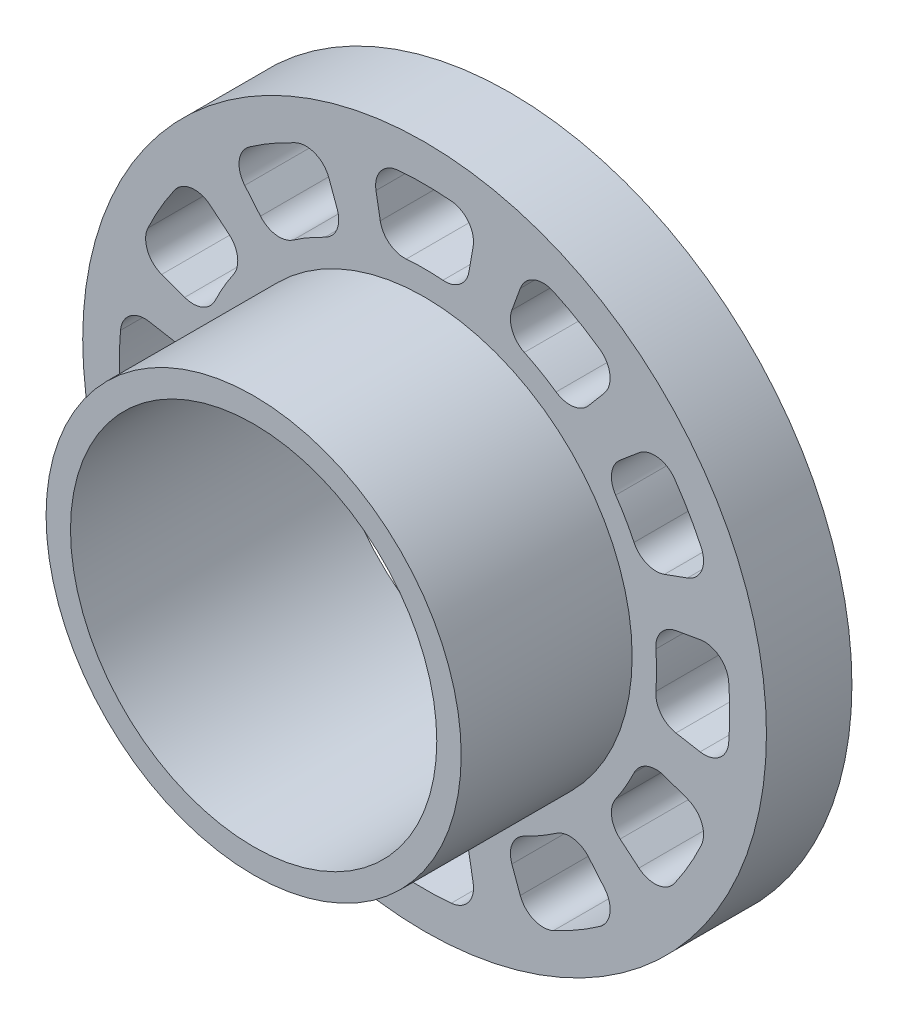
from build123d import *

# Parameters (mm, degrees)
SKETCH1_R           = 14
SKETCH1_R_2         = 7.5
BOSS_EXTRUDE1_DEPTH = 3.5
SKETCH2_R           = 8.5
SKETCH2_R_2         = 7.5
BOSS_EXTRUDE2_DEPTH = 7


with BuildPart() as part:
    # Sketch1 → Boss-Extrude1 (new body)
    with BuildSketch(Plane.XY):
        Circle(SKETCH1_R)
        Circle(SKETCH1_R_2, mode=Mode.SUBTRACT)
        with BuildLine():
            Line((-10.293478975, -1.815018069), (-11.282390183, -1.989389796))
            ThreePointArc((-11.282390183, -1.989389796), (-12.064720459, -1.79799625), (-12.452215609, -1.091937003))
            ThreePointArc((-12.452215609, -1.091937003), (-12.5, 0), (-12.452215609, 1.091937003))
            ThreePointArc((-12.452215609, 1.091937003), (-12.064720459, 1.79799625), (-11.282390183, 1.989389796))
            Line((-11.282390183, 1.989389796), (-10.293478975, 1.815018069))
            ThreePointArc((-10.293478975, 1.815018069), (-9.676250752, 1.442186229), (-9.4702579, 0.751142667))
            ThreePointArc((-9.4702579, 0.751142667), (-9.5, 0), (-9.4702579, -0.751142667))
            ThreePointArc((-9.4702579, -0.751142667), (-9.676250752, -1.442186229), (-10.293478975, -1.815018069))
        make_face(mode=Mode.SUBTRACT)
        with BuildLine():
            Line((-8.006905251, 6.718591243), (-8.776141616, 7.364057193))
            ThreePointArc((-8.776141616, 7.364057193), (-9.549356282, 7.589470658), (-10.237966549, 7.171752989))
            ThreePointArc((-10.237966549, 7.171752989), (-10.825317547, 6.25), (-11.329903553, 5.28046262))
            ThreePointArc((-11.329903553, 5.28046262), (-11.347352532, 4.475249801), (-10.765531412, 3.91833299))
            Line((-10.765531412, 3.91833299), (-9.82192332, 3.574887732))
            ThreePointArc((-9.82192332, 3.574887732), (-9.100972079, 3.589155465), (-8.577055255, 4.084620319))
            ThreePointArc((-8.577055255, 4.084620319), (-8.227241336, 4.75), (-7.825912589, 5.385637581))
            ThreePointArc((-7.825912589, 5.385637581), (-7.65878585, 6.087095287), (-8.006905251, 6.718591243))
        make_face(mode=Mode.SUBTRACT)
        with BuildLine():
            Line((-3.574887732, 9.82192332), (-3.91833299, 10.765531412))
            ThreePointArc((-3.91833299, 10.765531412), (-4.475249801, 11.347352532), (-5.28046262, 11.329903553))
            ThreePointArc((-5.28046262, 11.329903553), (-6.25, 10.825317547), (-7.171752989, 10.237966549))
            ThreePointArc((-7.171752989, 10.237966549), (-7.589470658, 9.549356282), (-7.364057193, 8.776141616))
            Line((-7.364057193, 8.776141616), (-6.718591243, 8.006905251))
            ThreePointArc((-6.718591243, 8.006905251), (-6.087095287, 7.65878585), (-5.385637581, 7.825912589))
            ThreePointArc((-5.385637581, 7.825912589), (-4.75, 8.227241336), (-4.084620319, 8.577055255))
            ThreePointArc((-4.084620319, 8.577055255), (-3.589155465, 9.100972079), (-3.574887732, 9.82192332))
        make_face(mode=Mode.SUBTRACT)
        with BuildLine():
            Line((1.815018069, 10.293478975), (1.989389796, 11.282390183))
            ThreePointArc((1.989389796, 11.282390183), (1.79799625, 12.064720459), (1.091937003, 12.452215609))
            ThreePointArc((1.091937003, 12.452215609), (0, 12.5), (-1.091937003, 12.452215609))
            ThreePointArc((-1.091937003, 12.452215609), (-1.79799625, 12.064720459), (-1.989389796, 11.282390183))
            Line((-1.989389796, 11.282390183), (-1.815018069, 10.293478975))
            ThreePointArc((-1.815018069, 10.293478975), (-1.442186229, 9.676250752), (-0.751142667, 9.4702579))
            ThreePointArc((-0.751142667, 9.4702579), (0, 9.5), (0.751142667, 9.4702579))
            ThreePointArc((0.751142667, 9.4702579), (1.442186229, 9.676250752), (1.815018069, 10.293478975))
        make_face(mode=Mode.SUBTRACT)
        with BuildLine():
            Line((6.718591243, 8.006905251), (7.364057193, 8.776141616))
            ThreePointArc((7.364057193, 8.776141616), (7.589470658, 9.549356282), (7.171752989, 10.237966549))
            ThreePointArc((7.171752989, 10.237966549), (6.25, 10.825317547), (5.28046262, 11.329903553))
            ThreePointArc((5.28046262, 11.329903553), (4.475249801, 11.347352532), (3.91833299, 10.765531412))
            Line((3.91833299, 10.765531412), (3.574887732, 9.82192332))
            ThreePointArc((3.574887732, 9.82192332), (3.589155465, 9.100972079), (4.084620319, 8.577055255))
            ThreePointArc((4.084620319, 8.577055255), (4.75, 8.227241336), (5.385637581, 7.825912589))
            ThreePointArc((5.385637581, 7.825912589), (6.087095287, 7.65878585), (6.718591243, 8.006905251))
        make_face(mode=Mode.SUBTRACT)
        with BuildLine():
            Line((9.82192332, 3.574887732), (10.765531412, 3.91833299))
            ThreePointArc((10.765531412, 3.91833299), (11.347352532, 4.475249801), (11.329903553, 5.28046262))
            ThreePointArc((11.329903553, 5.28046262), (10.825317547, 6.25), (10.237966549, 7.171752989))
            ThreePointArc((10.237966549, 7.171752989), (9.549356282, 7.589470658), (8.776141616, 7.364057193))
            Line((8.776141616, 7.364057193), (8.006905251, 6.718591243))
            ThreePointArc((8.006905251, 6.718591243), (7.65878585, 6.087095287), (7.825912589, 5.385637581))
            ThreePointArc((7.825912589, 5.385637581), (8.227241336, 4.75), (8.577055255, 4.084620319))
            ThreePointArc((8.577055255, 4.084620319), (9.100972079, 3.589155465), (9.82192332, 3.574887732))
        make_face(mode=Mode.SUBTRACT)
        with BuildLine():
            Line((10.293478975, -1.815018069), (11.282390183, -1.989389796))
            ThreePointArc((11.282390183, -1.989389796), (12.064720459, -1.79799625), (12.452215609, -1.091937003))
            ThreePointArc((12.452215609, -1.091937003), (12.5, 0), (12.452215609, 1.091937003))
            ThreePointArc((12.452215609, 1.091937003), (12.064720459, 1.79799625), (11.282390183, 1.989389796))
            Line((11.282390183, 1.989389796), (10.293478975, 1.815018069))
            ThreePointArc((10.293478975, 1.815018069), (9.676250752, 1.442186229), (9.4702579, 0.751142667))
            ThreePointArc((9.4702579, 0.751142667), (9.5, 0), (9.4702579, -0.751142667))
            ThreePointArc((9.4702579, -0.751142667), (9.676250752, -1.442186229), (10.293478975, -1.815018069))
        make_face(mode=Mode.SUBTRACT)
        with BuildLine():
            Line((8.006905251, -6.718591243), (8.776141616, -7.364057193))
            ThreePointArc((8.776141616, -7.364057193), (9.549356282, -7.589470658), (10.237966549, -7.171752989))
            ThreePointArc((10.237966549, -7.171752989), (10.825317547, -6.25), (11.329903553, -5.28046262))
            ThreePointArc((11.329903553, -5.28046262), (11.347352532, -4.475249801), (10.765531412, -3.91833299))
            Line((10.765531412, -3.91833299), (9.82192332, -3.574887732))
            ThreePointArc((9.82192332, -3.574887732), (9.100972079, -3.589155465), (8.577055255, -4.084620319))
            ThreePointArc((8.577055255, -4.084620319), (8.227241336, -4.75), (7.825912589, -5.385637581))
            ThreePointArc((7.825912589, -5.385637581), (7.65878585, -6.087095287), (8.006905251, -6.718591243))
        make_face(mode=Mode.SUBTRACT)
        with BuildLine():
            Line((3.574887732, -9.82192332), (3.91833299, -10.765531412))
            ThreePointArc((3.91833299, -10.765531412), (4.475249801, -11.347352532), (5.28046262, -11.329903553))
            ThreePointArc((5.28046262, -11.329903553), (6.25, -10.825317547), (7.171752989, -10.237966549))
            ThreePointArc((7.171752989, -10.237966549), (7.589470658, -9.549356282), (7.364057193, -8.776141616))
            Line((7.364057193, -8.776141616), (6.718591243, -8.006905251))
            ThreePointArc((6.718591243, -8.006905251), (6.087095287, -7.65878585), (5.385637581, -7.825912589))
            ThreePointArc((5.385637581, -7.825912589), (4.75, -8.227241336), (4.084620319, -8.577055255))
            ThreePointArc((4.084620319, -8.577055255), (3.589155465, -9.100972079), (3.574887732, -9.82192332))
        make_face(mode=Mode.SUBTRACT)
        with BuildLine():
            Line((-1.815018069, -10.293478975), (-1.989389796, -11.282390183))
            ThreePointArc((-1.989389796, -11.282390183), (-1.79799625, -12.064720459), (-1.091937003, -12.452215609))
            ThreePointArc((-1.091937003, -12.452215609), (0, -12.5), (1.091937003, -12.452215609))
            ThreePointArc((1.091937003, -12.452215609), (1.79799625, -12.064720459), (1.989389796, -11.282390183))
            Line((1.989389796, -11.282390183), (1.815018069, -10.293478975))
            ThreePointArc((1.815018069, -10.293478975), (1.442186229, -9.676250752), (0.751142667, -9.4702579))
            ThreePointArc((0.751142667, -9.4702579), (0, -9.5), (-0.751142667, -9.4702579))
            ThreePointArc((-0.751142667, -9.4702579), (-1.442186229, -9.676250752), (-1.815018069, -10.293478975))
        make_face(mode=Mode.SUBTRACT)
        with BuildLine():
            Line((-6.718591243, -8.006905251), (-7.364057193, -8.776141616))
            ThreePointArc((-7.364057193, -8.776141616), (-7.589470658, -9.549356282), (-7.171752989, -10.237966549))
            ThreePointArc((-7.171752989, -10.237966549), (-6.25, -10.825317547), (-5.28046262, -11.329903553))
            ThreePointArc((-5.28046262, -11.329903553), (-4.475249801, -11.347352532), (-3.91833299, -10.765531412))
            Line((-3.91833299, -10.765531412), (-3.574887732, -9.82192332))
            ThreePointArc((-3.574887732, -9.82192332), (-3.589155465, -9.100972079), (-4.084620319, -8.577055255))
            ThreePointArc((-4.084620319, -8.577055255), (-4.75, -8.227241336), (-5.385637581, -7.825912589))
            ThreePointArc((-5.385637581, -7.825912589), (-6.087095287, -7.65878585), (-6.718591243, -8.006905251))
        make_face(mode=Mode.SUBTRACT)
        with BuildLine():
            Line((-9.82192332, -3.574887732), (-10.765531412, -3.91833299))
            ThreePointArc((-10.765531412, -3.91833299), (-11.347352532, -4.475249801), (-11.329903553, -5.28046262))
            ThreePointArc((-11.329903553, -5.28046262), (-10.825317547, -6.25), (-10.237966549, -7.171752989))
            ThreePointArc((-10.237966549, -7.171752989), (-9.549356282, -7.589470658), (-8.776141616, -7.364057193))
            Line((-8.776141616, -7.364057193), (-8.006905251, -6.718591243))
            ThreePointArc((-8.006905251, -6.718591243), (-7.65878585, -6.087095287), (-7.825912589, -5.385637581))
            ThreePointArc((-7.825912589, -5.385637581), (-8.227241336, -4.75), (-8.577055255, -4.084620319))
            ThreePointArc((-8.577055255, -4.084620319), (-9.100972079, -3.589155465), (-9.82192332, -3.574887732))
        make_face(mode=Mode.SUBTRACT)
    extrude(amount=BOSS_EXTRUDE1_DEPTH)

    # Sketch2 → Boss-Extrude2 (add)
    with BuildSketch(Plane.XY.offset(3.5)):
        Circle(SKETCH2_R)
        Circle(SKETCH2_R_2, mode=Mode.SUBTRACT)
    extrude(amount=BOSS_EXTRUDE2_DEPTH)


solid = part.part
